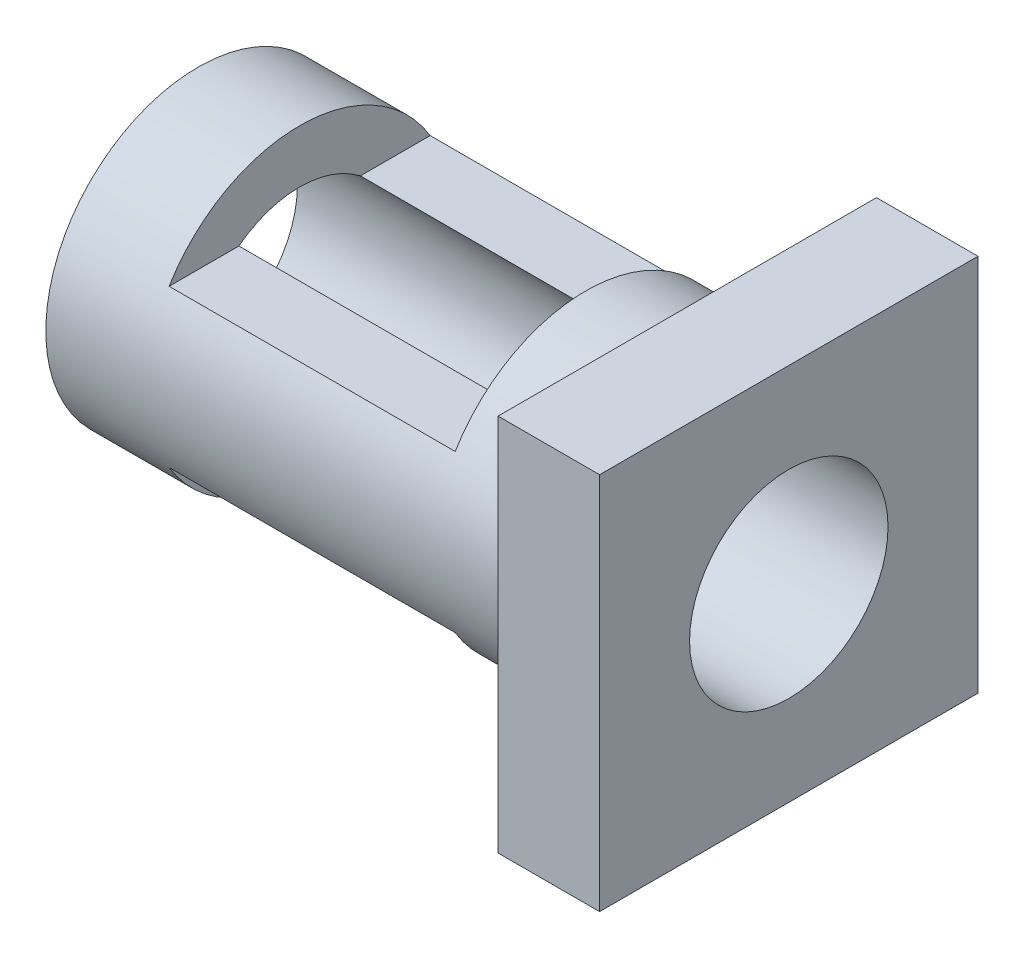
from build123d import *

# Parameters (mm, degrees)
SKETCH_1_R               = 66
EXTRUDE_1_DEPTH          = 212
SKETCH_2_W               = 164
SKETCH_2_H               = 164
EXTRUDE_2_DEPTH          = 44
SKETCH_3_R               = 43
CUT_EXTRUDE_1_DEPTH      = 282.040922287
CUT_EXTRUDE_2_DEPTH      = 242.644366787
CUT_EXTRUDE_2_DEPTH_BACK = 242.644366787
SKETCH_4_W               = 124
SKETCH_4_H               = 45.125241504
SKETCH_4_H_2             = 51.169530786


with BuildPart() as part:
    # Sketch 1 → Extrude 1 (new body)
    with BuildSketch(Plane(origin=(0, 0, 0), x_dir=(0, 0, -1), z_dir=(1, 0, 0))):
        Circle(SKETCH_1_R)
    extrude(amount=-EXTRUDE_1_DEPTH)

    # Sketch 2 → Extrude 2 (add)
    with BuildSketch(Plane(origin=(0, 0, 0), x_dir=(0, 0, -1), z_dir=(1, 0, 0))):
        Rectangle(SKETCH_2_W, SKETCH_2_H)
    extrude(amount=EXTRUDE_2_DEPTH)

    # Sketch 3 → Cut-Extrude 1 (cut, through all)
    with BuildSketch(Plane.ZY.offset(212)):
        Circle(SKETCH_3_R)
    extrude(amount=-CUT_EXTRUDE_1_DEPTH, mode=Mode.SUBTRACT)

    # Sketch 4 → Cut-Extrude 2 (cut, two sides: drawn at the far end of the back side and taken through both)
    with BuildSketch(Plane.XY.offset(-CUT_EXTRUDE_2_DEPTH_BACK)):
        with Locations((-106, 56.562620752)):
            Rectangle(SKETCH_4_W, SKETCH_4_H)
        with Locations((-106, -59.584765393)):
            Rectangle(SKETCH_4_W, SKETCH_4_H_2)
    extrude(amount=CUT_EXTRUDE_2_DEPTH + CUT_EXTRUDE_2_DEPTH_BACK, mode=Mode.SUBTRACT)


solid = part.part
